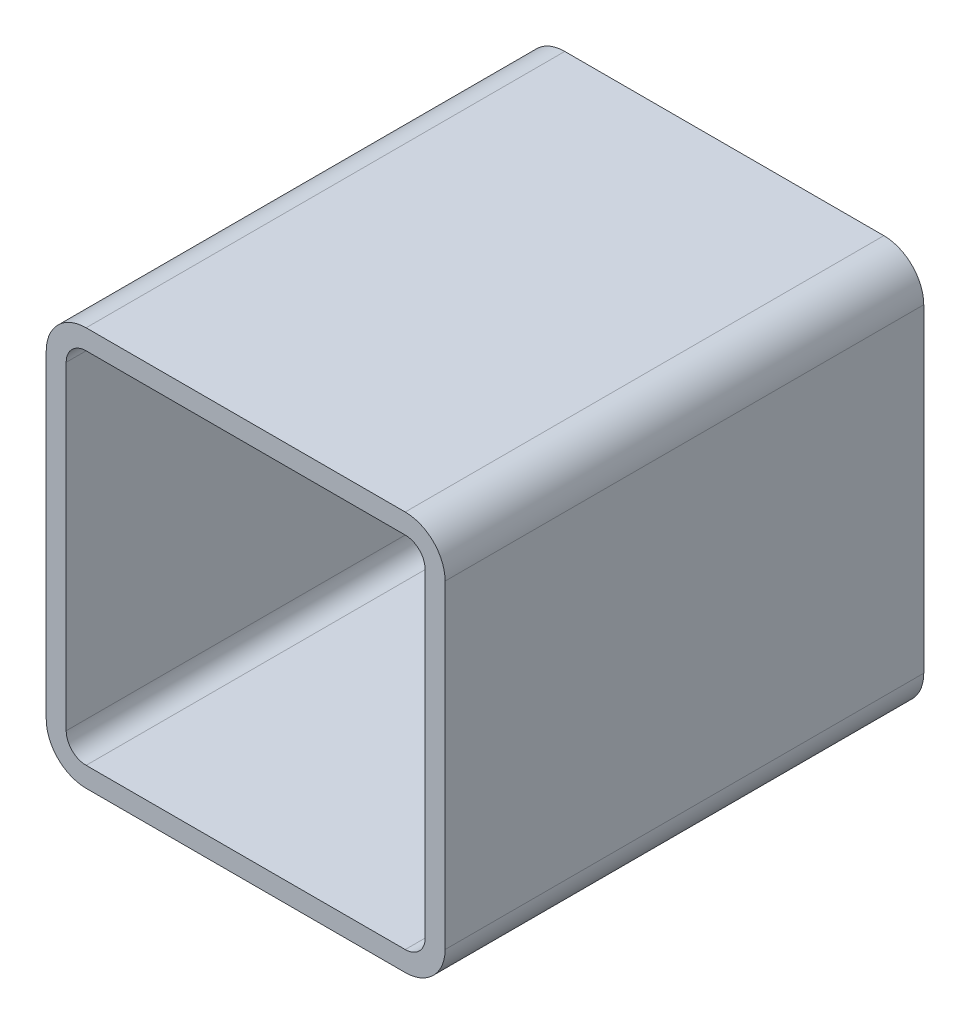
ISO-10303-21;
HEADER;
FILE_DESCRIPTION(('STEP AP214'),'2;1');
FILE_NAME('part.step','',(''),(''),'','','');
FILE_SCHEMA(('AUTOMOTIVE_DESIGN { 1 0 10303 214 1 1 1 1 }'));
ENDSEC;
DATA;
#1=APPLICATION_CONTEXT('core data for automotive mechanical design processes');
#2=APPLICATION_PROTOCOL_DEFINITION('international standard','automotive_design',2000,#1);
#3=PRODUCT_CONTEXT('',#1,'mechanical');
#4=PRODUCT('Part','Part','',(#3));
#5=PRODUCT_RELATED_PRODUCT_CATEGORY('part','',(#4));
#6=PRODUCT_DEFINITION_FORMATION('','',#4);
#7=PRODUCT_DEFINITION_CONTEXT('part definition',#1,'design');
#8=PRODUCT_DEFINITION('design','',#6,#7);
#9=PRODUCT_DEFINITION_SHAPE('','',#8);
#10=(LENGTH_UNIT() NAMED_UNIT(*) SI_UNIT(.MILLI.,.METRE.));
#11=(NAMED_UNIT(*) PLANE_ANGLE_UNIT() SI_UNIT($,.RADIAN.));
#12=(NAMED_UNIT(*) SI_UNIT($,.STERADIAN.) SOLID_ANGLE_UNIT());
#13=UNCERTAINTY_MEASURE_WITH_UNIT(LENGTH_MEASURE(1.E-05),#10,'distance_accuracy_value','');
#14=(GEOMETRIC_REPRESENTATION_CONTEXT(3) GLOBAL_UNCERTAINTY_ASSIGNED_CONTEXT((#13)) GLOBAL_UNIT_ASSIGNED_CONTEXT((#10,
#11,#12)) REPRESENTATION_CONTEXT('',''));
#15=CARTESIAN_POINT('',(0.,0.,0.));
#16=DIRECTION('',(0.,0.,1.));
#17=DIRECTION('',(1.,0.,0.));
#18=AXIS2_PLACEMENT_3D('',#15,#16,#17);
#19=CARTESIAN_POINT('',(28.1345794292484,230.520313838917,304.8));
#20=DIRECTION('',(0.,0.,1.));
#21=DIRECTION('',(1.,0.,0.));
#22=AXIS2_PLACEMENT_3D('',#19,#20,#21);
#23=PLANE('',#22);
#24=CARTESIAN_POINT('',(28.1345794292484,230.520313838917,304.8));
#25=DIRECTION('',(0.,0.,1.));
#26=DIRECTION('',(1.,0.,0.));
#27=AXIS2_PLACEMENT_3D('',#24,#25,#26);
#28=CIRCLE('',#27,25.4);
#29=CARTESIAN_POINT('',(28.1345794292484,255.920313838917,304.8));
#30=VERTEX_POINT('',#29);
#31=CARTESIAN_POINT('',(2.73457942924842,230.520313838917,304.8));
#32=VERTEX_POINT('',#31);
#33=EDGE_CURVE('E211',#30,#32,#28,.T.);
#34=ORIENTED_EDGE('',*,*,#33,.T.);
#35=DIRECTION('',(0.,-1.,0.));
#36=VECTOR('',#35,1.);
#37=CARTESIAN_POINT('',(2.73457942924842,27.3203138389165,304.8));
#38=LINE('',#37,#36);
#39=CARTESIAN_POINT('',(2.73457942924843,27.3203138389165,304.8));
#40=VERTEX_POINT('',#39);
#41=EDGE_CURVE('E214',#32,#40,#38,.T.);
#42=ORIENTED_EDGE('',*,*,#41,.T.);
#43=CARTESIAN_POINT('',(28.1345794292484,27.3203138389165,304.8));
#44=DIRECTION('',(0.,0.,1.));
#45=DIRECTION('',(1.,0.,0.));
#46=AXIS2_PLACEMENT_3D('',#43,#44,#45);
#47=CIRCLE('',#46,25.4);
#48=CARTESIAN_POINT('',(28.1345794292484,1.92031383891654,304.8));
#49=VERTEX_POINT('',#48);
#50=EDGE_CURVE('E217',#40,#49,#47,.T.);
#51=ORIENTED_EDGE('',*,*,#50,.T.);
#52=DIRECTION('',(1.,0.,0.));
#53=VECTOR('',#52,1.);
#54=CARTESIAN_POINT('',(231.334579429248,1.92031383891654,304.8));
#55=LINE('',#54,#53);
#56=CARTESIAN_POINT('',(231.334579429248,1.92031383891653,304.8));
#57=VERTEX_POINT('',#56);
#58=EDGE_CURVE('E219',#49,#57,#55,.T.);
#59=ORIENTED_EDGE('',*,*,#58,.T.);
#60=CARTESIAN_POINT('',(231.334579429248,27.3203138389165,304.8));
#61=DIRECTION('',(0.,0.,1.));
#62=DIRECTION('',(1.,0.,0.));
#63=AXIS2_PLACEMENT_3D('',#60,#61,#62);
#64=CIRCLE('',#63,25.4);
#65=CARTESIAN_POINT('',(256.734579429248,27.3203138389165,304.8));
#66=VERTEX_POINT('',#65);
#67=EDGE_CURVE('E221',#57,#66,#64,.T.);
#68=ORIENTED_EDGE('',*,*,#67,.T.);
#69=DIRECTION('',(0.,1.,0.));
#70=VECTOR('',#69,1.);
#71=CARTESIAN_POINT('',(256.734579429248,230.520313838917,304.8));
#72=LINE('',#71,#70);
#73=CARTESIAN_POINT('',(256.734579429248,230.520313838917,304.8));
#74=VERTEX_POINT('',#73);
#75=EDGE_CURVE('E223',#66,#74,#72,.T.);
#76=ORIENTED_EDGE('',*,*,#75,.T.);
#77=CARTESIAN_POINT('',(231.334579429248,230.520313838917,304.8));
#78=DIRECTION('',(0.,0.,1.));
#79=DIRECTION('',(1.,0.,0.));
#80=AXIS2_PLACEMENT_3D('',#77,#78,#79);
#81=CIRCLE('',#80,25.4);
#82=CARTESIAN_POINT('',(231.334579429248,255.920313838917,304.8));
#83=VERTEX_POINT('',#82);
#84=EDGE_CURVE('E225',#74,#83,#81,.T.);
#85=ORIENTED_EDGE('',*,*,#84,.T.);
#86=DIRECTION('',(-1.,0.,0.));
#87=VECTOR('',#86,1.);
#88=CARTESIAN_POINT('',(28.1345794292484,255.920313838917,304.8));
#89=LINE('',#88,#87);
#90=EDGE_CURVE('E227',#83,#30,#89,.T.);
#91=ORIENTED_EDGE('',*,*,#90,.T.);
#92=EDGE_LOOP('',(#34,#42,#51,#59,#68,#76,#85,#91));
#93=FACE_BOUND('',#92,.T.);
#94=DIRECTION('',(0.,-1.,0.));
#95=VECTOR('',#94,1.);
#96=CARTESIAN_POINT('',(15.4345794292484,27.3203138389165,304.8));
#97=LINE('',#96,#95);
#98=CARTESIAN_POINT('',(15.4345794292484,230.520313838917,304.8));
#99=VERTEX_POINT('',#98);
#100=CARTESIAN_POINT('',(15.4345794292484,27.3203138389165,304.8));
#101=VERTEX_POINT('',#100);
#102=EDGE_CURVE('E154',#99,#101,#97,.T.);
#103=ORIENTED_EDGE('',*,*,#102,.F.);
#104=CARTESIAN_POINT('',(28.1345794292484,230.520313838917,304.8));
#105=DIRECTION('',(0.,0.,1.));
#106=DIRECTION('',(1.,0.,0.));
#107=AXIS2_PLACEMENT_3D('',#104,#105,#106);
#108=CIRCLE('',#107,12.7);
#109=CARTESIAN_POINT('',(28.1345794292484,243.220313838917,304.8));
#110=VERTEX_POINT('',#109);
#111=EDGE_CURVE('E146',#110,#99,#108,.T.);
#112=ORIENTED_EDGE('',*,*,#111,.F.);
#113=DIRECTION('',(-1.,0.,0.));
#114=VECTOR('',#113,1.);
#115=CARTESIAN_POINT('',(28.1345794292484,243.220313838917,304.8));
#116=LINE('',#115,#114);
#117=CARTESIAN_POINT('',(231.334579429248,243.220313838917,304.8));
#118=VERTEX_POINT('',#117);
#119=EDGE_CURVE('E179',#118,#110,#116,.T.);
#120=ORIENTED_EDGE('',*,*,#119,.F.);
#121=CARTESIAN_POINT('',(231.334579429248,230.520313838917,304.8));
#122=DIRECTION('',(0.,0.,1.));
#123=DIRECTION('',(1.,0.,0.));
#124=AXIS2_PLACEMENT_3D('',#121,#122,#123);
#125=CIRCLE('',#124,12.7);
#126=CARTESIAN_POINT('',(244.034579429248,230.520313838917,304.8));
#127=VERTEX_POINT('',#126);
#128=EDGE_CURVE('E177',#127,#118,#125,.T.);
#129=ORIENTED_EDGE('',*,*,#128,.F.);
#130=DIRECTION('',(0.,1.,0.));
#131=VECTOR('',#130,1.);
#132=CARTESIAN_POINT('',(244.034579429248,230.520313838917,304.8));
#133=LINE('',#132,#131);
#134=CARTESIAN_POINT('',(244.034579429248,27.3203138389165,304.8));
#135=VERTEX_POINT('',#134);
#136=EDGE_CURVE('E175',#135,#127,#133,.T.);
#137=ORIENTED_EDGE('',*,*,#136,.F.);
#138=CARTESIAN_POINT('',(231.334579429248,27.3203138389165,304.8));
#139=DIRECTION('',(0.,0.,1.));
#140=DIRECTION('',(1.,0.,0.));
#141=AXIS2_PLACEMENT_3D('',#138,#139,#140);
#142=CIRCLE('',#141,12.7);
#143=CARTESIAN_POINT('',(231.334579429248,14.6203138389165,304.8));
#144=VERTEX_POINT('',#143);
#145=EDGE_CURVE('E173',#144,#135,#142,.T.);
#146=ORIENTED_EDGE('',*,*,#145,.F.);
#147=DIRECTION('',(1.,0.,0.));
#148=VECTOR('',#147,1.);
#149=CARTESIAN_POINT('',(231.334579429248,14.6203138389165,304.8));
#150=LINE('',#149,#148);
#151=CARTESIAN_POINT('',(28.1345794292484,14.6203138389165,304.8));
#152=VERTEX_POINT('',#151);
#153=EDGE_CURVE('E169',#152,#144,#150,.T.);
#154=ORIENTED_EDGE('',*,*,#153,.F.);
#155=CARTESIAN_POINT('',(28.1345794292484,27.3203138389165,304.8));
#156=DIRECTION('',(0.,0.,1.));
#157=DIRECTION('',(1.,0.,0.));
#158=AXIS2_PLACEMENT_3D('',#155,#156,#157);
#159=CIRCLE('',#158,12.7);
#160=EDGE_CURVE('E167',#101,#152,#159,.T.);
#161=ORIENTED_EDGE('',*,*,#160,.F.);
#162=EDGE_LOOP('',(#103,#112,#120,#129,#137,#146,#154,#161));
#163=FACE_BOUND('',#162,.T.);
#164=ADVANCED_FACE('F33',(#93,#163),#23,.T.);
#165=CARTESIAN_POINT('',(28.1345794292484,230.520313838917,0.));
#166=DIRECTION('',(0.,0.,1.));
#167=DIRECTION('',(1.,0.,0.));
#168=AXIS2_PLACEMENT_3D('',#165,#166,#167);
#169=PLANE('',#168);
#170=CARTESIAN_POINT('',(28.1345794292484,230.520313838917,0.));
#171=DIRECTION('',(0.,0.,1.));
#172=DIRECTION('',(1.,0.,0.));
#173=AXIS2_PLACEMENT_3D('',#170,#171,#172);
#174=CIRCLE('',#173,25.4);
#175=CARTESIAN_POINT('',(28.1345794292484,255.920313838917,0.));
#176=VERTEX_POINT('',#175);
#177=CARTESIAN_POINT('',(2.73457942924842,230.520313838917,0.));
#178=VERTEX_POINT('',#177);
#179=EDGE_CURVE('E162',#176,#178,#174,.T.);
#180=ORIENTED_EDGE('',*,*,#179,.F.);
#181=DIRECTION('',(-1.,0.,0.));
#182=VECTOR('',#181,1.);
#183=CARTESIAN_POINT('',(28.1345794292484,255.920313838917,0.));
#184=LINE('',#183,#182);
#185=CARTESIAN_POINT('',(231.334579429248,255.920313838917,0.));
#186=VERTEX_POINT('',#185);
#187=EDGE_CURVE('E215',#186,#176,#184,.T.);
#188=ORIENTED_EDGE('',*,*,#187,.F.);
#189=CARTESIAN_POINT('',(231.334579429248,230.520313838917,0.));
#190=DIRECTION('',(0.,0.,1.));
#191=DIRECTION('',(1.,0.,0.));
#192=AXIS2_PLACEMENT_3D('',#189,#190,#191);
#193=CIRCLE('',#192,25.4);
#194=CARTESIAN_POINT('',(256.734579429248,230.520313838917,0.));
#195=VERTEX_POINT('',#194);
#196=EDGE_CURVE('E242',#195,#186,#193,.T.);
#197=ORIENTED_EDGE('',*,*,#196,.F.);
#198=DIRECTION('',(0.,1.,0.));
#199=VECTOR('',#198,1.);
#200=CARTESIAN_POINT('',(256.734579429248,230.520313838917,0.));
#201=LINE('',#200,#199);
#202=CARTESIAN_POINT('',(256.734579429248,27.3203138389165,0.));
#203=VERTEX_POINT('',#202);
#204=EDGE_CURVE('E240',#203,#195,#201,.T.);
#205=ORIENTED_EDGE('',*,*,#204,.F.);
#206=CARTESIAN_POINT('',(231.334579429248,27.3203138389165,0.));
#207=DIRECTION('',(0.,0.,1.));
#208=DIRECTION('',(1.,0.,0.));
#209=AXIS2_PLACEMENT_3D('',#206,#207,#208);
#210=CIRCLE('',#209,25.4);
#211=CARTESIAN_POINT('',(231.334579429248,1.92031383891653,0.));
#212=VERTEX_POINT('',#211);
#213=EDGE_CURVE('E238',#212,#203,#210,.T.);
#214=ORIENTED_EDGE('',*,*,#213,.F.);
#215=DIRECTION('',(1.,0.,0.));
#216=VECTOR('',#215,1.);
#217=CARTESIAN_POINT('',(231.334579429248,1.92031383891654,0.));
#218=LINE('',#217,#216);
#219=CARTESIAN_POINT('',(28.1345794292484,1.92031383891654,0.));
#220=VERTEX_POINT('',#219);
#221=EDGE_CURVE('E236',#220,#212,#218,.T.);
#222=ORIENTED_EDGE('',*,*,#221,.F.);
#223=CARTESIAN_POINT('',(28.1345794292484,27.3203138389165,0.));
#224=DIRECTION('',(0.,0.,1.));
#225=DIRECTION('',(1.,0.,0.));
#226=AXIS2_PLACEMENT_3D('',#223,#224,#225);
#227=CIRCLE('',#226,25.4);
#228=CARTESIAN_POINT('',(2.73457942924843,27.3203138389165,0.));
#229=VERTEX_POINT('',#228);
#230=EDGE_CURVE('E234',#229,#220,#227,.T.);
#231=ORIENTED_EDGE('',*,*,#230,.F.);
#232=DIRECTION('',(0.,-1.,0.));
#233=VECTOR('',#232,1.);
#234=CARTESIAN_POINT('',(2.73457942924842,27.3203138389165,0.));
#235=LINE('',#234,#233);
#236=EDGE_CURVE('E232',#178,#229,#235,.T.);
#237=ORIENTED_EDGE('',*,*,#236,.F.);
#238=EDGE_LOOP('',(#180,#188,#197,#205,#214,#222,#231,#237));
#239=FACE_BOUND('',#238,.T.);
#240=CARTESIAN_POINT('',(28.1345794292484,230.520313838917,0.));
#241=DIRECTION('',(0.,0.,1.));
#242=DIRECTION('',(1.,0.,0.));
#243=AXIS2_PLACEMENT_3D('',#240,#241,#242);
#244=CIRCLE('',#243,12.7);
#245=CARTESIAN_POINT('',(28.1345794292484,243.220313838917,0.));
#246=VERTEX_POINT('',#245);
#247=CARTESIAN_POINT('',(15.4345794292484,230.520313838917,0.));
#248=VERTEX_POINT('',#247);
#249=EDGE_CURVE('E56',#246,#248,#244,.T.);
#250=ORIENTED_EDGE('',*,*,#249,.T.);
#251=DIRECTION('',(0.,-1.,0.));
#252=VECTOR('',#251,1.);
#253=CARTESIAN_POINT('',(15.4345794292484,27.3203138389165,0.));
#254=LINE('',#253,#252);
#255=CARTESIAN_POINT('',(15.4345794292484,27.3203138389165,0.));
#256=VERTEX_POINT('',#255);
#257=EDGE_CURVE('E161',#248,#256,#254,.T.);
#258=ORIENTED_EDGE('',*,*,#257,.T.);
#259=CARTESIAN_POINT('',(28.1345794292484,27.3203138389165,0.));
#260=DIRECTION('',(0.,0.,1.));
#261=DIRECTION('',(1.,0.,0.));
#262=AXIS2_PLACEMENT_3D('',#259,#260,#261);
#263=CIRCLE('',#262,12.7);
#264=CARTESIAN_POINT('',(28.1345794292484,14.6203138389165,0.));
#265=VERTEX_POINT('',#264);
#266=EDGE_CURVE('E183',#256,#265,#263,.T.);
#267=ORIENTED_EDGE('',*,*,#266,.T.);
#268=DIRECTION('',(1.,0.,0.));
#269=VECTOR('',#268,1.);
#270=CARTESIAN_POINT('',(231.334579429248,14.6203138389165,0.));
#271=LINE('',#270,#269);
#272=CARTESIAN_POINT('',(231.334579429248,14.6203138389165,0.));
#273=VERTEX_POINT('',#272);
#274=EDGE_CURVE('E186',#265,#273,#271,.T.);
#275=ORIENTED_EDGE('',*,*,#274,.T.);
#276=CARTESIAN_POINT('',(231.334579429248,27.3203138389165,0.));
#277=DIRECTION('',(0.,0.,1.));
#278=DIRECTION('',(1.,0.,0.));
#279=AXIS2_PLACEMENT_3D('',#276,#277,#278);
#280=CIRCLE('',#279,12.7);
#281=CARTESIAN_POINT('',(244.034579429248,27.3203138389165,0.));
#282=VERTEX_POINT('',#281);
#283=EDGE_CURVE('E189',#273,#282,#280,.T.);
#284=ORIENTED_EDGE('',*,*,#283,.T.);
#285=DIRECTION('',(0.,1.,0.));
#286=VECTOR('',#285,1.);
#287=CARTESIAN_POINT('',(244.034579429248,230.520313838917,0.));
#288=LINE('',#287,#286);
#289=CARTESIAN_POINT('',(244.034579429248,230.520313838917,0.));
#290=VERTEX_POINT('',#289);
#291=EDGE_CURVE('E192',#282,#290,#288,.T.);
#292=ORIENTED_EDGE('',*,*,#291,.T.);
#293=CARTESIAN_POINT('',(231.334579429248,230.520313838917,0.));
#294=DIRECTION('',(0.,0.,1.));
#295=DIRECTION('',(1.,0.,0.));
#296=AXIS2_PLACEMENT_3D('',#293,#294,#295);
#297=CIRCLE('',#296,12.7);
#298=CARTESIAN_POINT('',(231.334579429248,243.220313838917,0.));
#299=VERTEX_POINT('',#298);
#300=EDGE_CURVE('E195',#290,#299,#297,.T.);
#301=ORIENTED_EDGE('',*,*,#300,.T.);
#302=DIRECTION('',(-1.,0.,0.));
#303=VECTOR('',#302,1.);
#304=CARTESIAN_POINT('',(28.1345794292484,243.220313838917,0.));
#305=LINE('',#304,#303);
#306=EDGE_CURVE('E155',#299,#246,#305,.T.);
#307=ORIENTED_EDGE('',*,*,#306,.T.);
#308=EDGE_LOOP('',(#250,#258,#267,#275,#284,#292,#301,#307));
#309=FACE_BOUND('',#308,.T.);
#310=ADVANCED_FACE('F272',(#239,#309),#169,.F.);
#311=CARTESIAN_POINT('',(28.1345794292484,230.520313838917,304.8));
#312=DIRECTION('',(0.,0.,-1.));
#313=DIRECTION('',(-1.,0.,0.));
#314=AXIS2_PLACEMENT_3D('',#311,#312,#313);
#315=CYLINDRICAL_SURFACE('',#314,25.4);
#316=ORIENTED_EDGE('',*,*,#179,.T.);
#317=DIRECTION('',(0.,0.,-1.));
#318=VECTOR('',#317,1.);
#319=CARTESIAN_POINT('',(2.73457942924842,230.520313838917,304.8));
#320=LINE('',#319,#318);
#321=EDGE_CURVE('E11',#32,#178,#320,.T.);
#322=ORIENTED_EDGE('',*,*,#321,.F.);
#323=ORIENTED_EDGE('',*,*,#33,.F.);
#324=DIRECTION('',(0.,0.,-1.));
#325=VECTOR('',#324,1.);
#326=CARTESIAN_POINT('',(28.1345794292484,255.920313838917,304.8));
#327=LINE('',#326,#325);
#328=EDGE_CURVE('E229',#30,#176,#327,.T.);
#329=ORIENTED_EDGE('',*,*,#328,.T.);
#330=EDGE_LOOP('',(#316,#322,#323,#329));
#331=FACE_BOUND('',#330,.T.);
#332=ADVANCED_FACE('F35',(#331),#315,.T.);
#333=CARTESIAN_POINT('',(2.73457942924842,27.3203138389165,304.8));
#334=DIRECTION('',(1.,0.,0.));
#335=DIRECTION('',(0.,0.,-1.));
#336=AXIS2_PLACEMENT_3D('',#333,#334,#335);
#337=PLANE('',#336);
#338=ORIENTED_EDGE('',*,*,#236,.T.);
#339=DIRECTION('',(0.,0.,-1.));
#340=VECTOR('',#339,1.);
#341=CARTESIAN_POINT('',(2.73457942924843,27.3203138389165,304.8));
#342=LINE('',#341,#340);
#343=EDGE_CURVE('E41',#40,#229,#342,.T.);
#344=ORIENTED_EDGE('',*,*,#343,.F.);
#345=ORIENTED_EDGE('',*,*,#41,.F.);
#346=ORIENTED_EDGE('',*,*,#321,.T.);
#347=EDGE_LOOP('',(#338,#344,#345,#346));
#348=FACE_BOUND('',#347,.T.);
#349=ADVANCED_FACE('F289',(#348),#337,.F.);
#350=CARTESIAN_POINT('',(28.1345794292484,27.3203138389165,304.8));
#351=DIRECTION('',(0.,0.,-1.));
#352=DIRECTION('',(-1.,0.,0.));
#353=AXIS2_PLACEMENT_3D('',#350,#351,#352);
#354=CYLINDRICAL_SURFACE('',#353,25.4);
#355=ORIENTED_EDGE('',*,*,#230,.T.);
#356=DIRECTION('',(0.,0.,-1.));
#357=VECTOR('',#356,1.);
#358=CARTESIAN_POINT('',(28.1345794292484,1.92031383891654,304.8));
#359=LINE('',#358,#357);
#360=EDGE_CURVE('E259',#49,#220,#359,.T.);
#361=ORIENTED_EDGE('',*,*,#360,.F.);
#362=ORIENTED_EDGE('',*,*,#50,.F.);
#363=ORIENTED_EDGE('',*,*,#343,.T.);
#364=EDGE_LOOP('',(#355,#361,#362,#363));
#365=FACE_BOUND('',#364,.T.);
#366=ADVANCED_FACE('F266',(#365),#354,.T.);
#367=CARTESIAN_POINT('',(231.334579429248,1.92031383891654,304.8));
#368=DIRECTION('',(0.,1.,0.));
#369=DIRECTION('',(0.,0.,1.));
#370=AXIS2_PLACEMENT_3D('',#367,#368,#369);
#371=PLANE('',#370);
#372=ORIENTED_EDGE('',*,*,#221,.T.);
#373=DIRECTION('',(0.,0.,-1.));
#374=VECTOR('',#373,1.);
#375=CARTESIAN_POINT('',(231.334579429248,1.92031383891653,304.8));
#376=LINE('',#375,#374);
#377=EDGE_CURVE('E256',#57,#212,#376,.T.);
#378=ORIENTED_EDGE('',*,*,#377,.F.);
#379=ORIENTED_EDGE('',*,*,#58,.F.);
#380=ORIENTED_EDGE('',*,*,#360,.T.);
#381=EDGE_LOOP('',(#372,#378,#379,#380));
#382=FACE_BOUND('',#381,.T.);
#383=ADVANCED_FACE('F278',(#382),#371,.F.);
#384=CARTESIAN_POINT('',(231.334579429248,27.3203138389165,304.8));
#385=DIRECTION('',(0.,0.,-1.));
#386=DIRECTION('',(-1.,0.,0.));
#387=AXIS2_PLACEMENT_3D('',#384,#385,#386);
#388=CYLINDRICAL_SURFACE('',#387,25.4);
#389=ORIENTED_EDGE('',*,*,#213,.T.);
#390=DIRECTION('',(0.,0.,-1.));
#391=VECTOR('',#390,1.);
#392=CARTESIAN_POINT('',(256.734579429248,27.3203138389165,304.8));
#393=LINE('',#392,#391);
#394=EDGE_CURVE('E253',#66,#203,#393,.T.);
#395=ORIENTED_EDGE('',*,*,#394,.F.);
#396=ORIENTED_EDGE('',*,*,#67,.F.);
#397=ORIENTED_EDGE('',*,*,#377,.T.);
#398=EDGE_LOOP('',(#389,#395,#396,#397));
#399=FACE_BOUND('',#398,.T.);
#400=ADVANCED_FACE('F282',(#399),#388,.T.);
#401=CARTESIAN_POINT('',(256.734579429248,230.520313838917,304.8));
#402=DIRECTION('',(-1.,0.,0.));
#403=DIRECTION('',(0.,0.,1.));
#404=AXIS2_PLACEMENT_3D('',#401,#402,#403);
#405=PLANE('',#404);
#406=ORIENTED_EDGE('',*,*,#204,.T.);
#407=DIRECTION('',(0.,0.,-1.));
#408=VECTOR('',#407,1.);
#409=CARTESIAN_POINT('',(256.734579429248,230.520313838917,304.8));
#410=LINE('',#409,#408);
#411=EDGE_CURVE('E250',#74,#195,#410,.T.);
#412=ORIENTED_EDGE('',*,*,#411,.F.);
#413=ORIENTED_EDGE('',*,*,#75,.F.);
#414=ORIENTED_EDGE('',*,*,#394,.T.);
#415=EDGE_LOOP('',(#406,#412,#413,#414));
#416=FACE_BOUND('',#415,.T.);
#417=ADVANCED_FACE('F302',(#416),#405,.F.);
#418=CARTESIAN_POINT('',(231.334579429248,230.520313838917,304.8));
#419=DIRECTION('',(0.,0.,-1.));
#420=DIRECTION('',(-1.,0.,0.));
#421=AXIS2_PLACEMENT_3D('',#418,#419,#420);
#422=CYLINDRICAL_SURFACE('',#421,25.4);
#423=ORIENTED_EDGE('',*,*,#196,.T.);
#424=DIRECTION('',(0.,0.,-1.));
#425=VECTOR('',#424,1.);
#426=CARTESIAN_POINT('',(231.334579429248,255.920313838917,304.8));
#427=LINE('',#426,#425);
#428=EDGE_CURVE('E247',#83,#186,#427,.T.);
#429=ORIENTED_EDGE('',*,*,#428,.F.);
#430=ORIENTED_EDGE('',*,*,#84,.F.);
#431=ORIENTED_EDGE('',*,*,#411,.T.);
#432=EDGE_LOOP('',(#423,#429,#430,#431));
#433=FACE_BOUND('',#432,.T.);
#434=ADVANCED_FACE('F300',(#433),#422,.T.);
#435=CARTESIAN_POINT('',(28.1345794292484,255.920313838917,304.8));
#436=DIRECTION('',(0.,-1.,0.));
#437=DIRECTION('',(0.,0.,-1.));
#438=AXIS2_PLACEMENT_3D('',#435,#436,#437);
#439=PLANE('',#438);
#440=ORIENTED_EDGE('',*,*,#187,.T.);
#441=ORIENTED_EDGE('',*,*,#328,.F.);
#442=ORIENTED_EDGE('',*,*,#90,.F.);
#443=ORIENTED_EDGE('',*,*,#428,.T.);
#444=EDGE_LOOP('',(#440,#441,#442,#443));
#445=FACE_BOUND('',#444,.T.);
#446=ADVANCED_FACE('F295',(#445),#439,.F.);
#447=CARTESIAN_POINT('',(28.1345794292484,230.520313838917,304.8));
#448=DIRECTION('',(0.,0.,-1.));
#449=DIRECTION('',(-1.,0.,0.));
#450=AXIS2_PLACEMENT_3D('',#447,#448,#449);
#451=CYLINDRICAL_SURFACE('',#450,12.7);
#452=ORIENTED_EDGE('',*,*,#249,.F.);
#453=DIRECTION('',(0.,0.,-1.));
#454=VECTOR('',#453,1.);
#455=CARTESIAN_POINT('',(28.1345794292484,243.220313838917,304.8));
#456=LINE('',#455,#454);
#457=EDGE_CURVE('E150',#110,#246,#456,.T.);
#458=ORIENTED_EDGE('',*,*,#457,.F.);
#459=ORIENTED_EDGE('',*,*,#111,.T.);
#460=DIRECTION('',(0.,0.,-1.));
#461=VECTOR('',#460,1.);
#462=CARTESIAN_POINT('',(15.4345794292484,230.520313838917,304.8));
#463=LINE('',#462,#461);
#464=EDGE_CURVE('E149',#99,#248,#463,.T.);
#465=ORIENTED_EDGE('',*,*,#464,.T.);
#466=EDGE_LOOP('',(#452,#458,#459,#465));
#467=FACE_BOUND('',#466,.T.);
#468=ADVANCED_FACE('F148',(#467),#451,.F.);
#469=CARTESIAN_POINT('',(15.4345794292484,27.3203138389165,304.8));
#470=DIRECTION('',(1.,0.,0.));
#471=DIRECTION('',(0.,0.,-1.));
#472=AXIS2_PLACEMENT_3D('',#469,#470,#471);
#473=PLANE('',#472);
#474=ORIENTED_EDGE('',*,*,#257,.F.);
#475=ORIENTED_EDGE('',*,*,#464,.F.);
#476=ORIENTED_EDGE('',*,*,#102,.T.);
#477=DIRECTION('',(0.,0.,-1.));
#478=VECTOR('',#477,1.);
#479=CARTESIAN_POINT('',(15.4345794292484,27.3203138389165,304.8));
#480=LINE('',#479,#478);
#481=EDGE_CURVE('E163',#101,#256,#480,.T.);
#482=ORIENTED_EDGE('',*,*,#481,.T.);
#483=EDGE_LOOP('',(#474,#475,#476,#482));
#484=FACE_BOUND('',#483,.T.);
#485=ADVANCED_FACE('F158',(#484),#473,.T.);
#486=CARTESIAN_POINT('',(28.1345794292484,27.3203138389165,304.8));
#487=DIRECTION('',(0.,0.,-1.));
#488=DIRECTION('',(-1.,0.,0.));
#489=AXIS2_PLACEMENT_3D('',#486,#487,#488);
#490=CYLINDRICAL_SURFACE('',#489,12.7);
#491=ORIENTED_EDGE('',*,*,#266,.F.);
#492=ORIENTED_EDGE('',*,*,#481,.F.);
#493=ORIENTED_EDGE('',*,*,#160,.T.);
#494=DIRECTION('',(0.,0.,-1.));
#495=VECTOR('',#494,1.);
#496=CARTESIAN_POINT('',(28.1345794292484,14.6203138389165,304.8));
#497=LINE('',#496,#495);
#498=EDGE_CURVE('E208',#152,#265,#497,.T.);
#499=ORIENTED_EDGE('',*,*,#498,.T.);
#500=EDGE_LOOP('',(#491,#492,#493,#499));
#501=FACE_BOUND('',#500,.T.);
#502=ADVANCED_FACE('F327',(#501),#490,.F.);
#503=CARTESIAN_POINT('',(231.334579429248,14.6203138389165,304.8));
#504=DIRECTION('',(0.,1.,0.));
#505=DIRECTION('',(0.,0.,1.));
#506=AXIS2_PLACEMENT_3D('',#503,#504,#505);
#507=PLANE('',#506);
#508=ORIENTED_EDGE('',*,*,#274,.F.);
#509=ORIENTED_EDGE('',*,*,#498,.F.);
#510=ORIENTED_EDGE('',*,*,#153,.T.);
#511=DIRECTION('',(0.,0.,-1.));
#512=VECTOR('',#511,1.);
#513=CARTESIAN_POINT('',(231.334579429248,14.6203138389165,304.8));
#514=LINE('',#513,#512);
#515=EDGE_CURVE('E206',#144,#273,#514,.T.);
#516=ORIENTED_EDGE('',*,*,#515,.T.);
#517=EDGE_LOOP('',(#508,#509,#510,#516));
#518=FACE_BOUND('',#517,.T.);
#519=ADVANCED_FACE('F331',(#518),#507,.T.);
#520=CARTESIAN_POINT('',(231.334579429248,27.3203138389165,304.8));
#521=DIRECTION('',(0.,0.,-1.));
#522=DIRECTION('',(-1.,0.,0.));
#523=AXIS2_PLACEMENT_3D('',#520,#521,#522);
#524=CYLINDRICAL_SURFACE('',#523,12.7);
#525=ORIENTED_EDGE('',*,*,#283,.F.);
#526=ORIENTED_EDGE('',*,*,#515,.F.);
#527=ORIENTED_EDGE('',*,*,#145,.T.);
#528=DIRECTION('',(0.,0.,-1.));
#529=VECTOR('',#528,1.);
#530=CARTESIAN_POINT('',(244.034579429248,27.3203138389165,304.8));
#531=LINE('',#530,#529);
#532=EDGE_CURVE('E204',#135,#282,#531,.T.);
#533=ORIENTED_EDGE('',*,*,#532,.T.);
#534=EDGE_LOOP('',(#525,#526,#527,#533));
#535=FACE_BOUND('',#534,.T.);
#536=ADVANCED_FACE('F337',(#535),#524,.F.);
#537=CARTESIAN_POINT('',(244.034579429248,230.520313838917,304.8));
#538=DIRECTION('',(-1.,0.,0.));
#539=DIRECTION('',(0.,0.,1.));
#540=AXIS2_PLACEMENT_3D('',#537,#538,#539);
#541=PLANE('',#540);
#542=ORIENTED_EDGE('',*,*,#291,.F.);
#543=ORIENTED_EDGE('',*,*,#532,.F.);
#544=ORIENTED_EDGE('',*,*,#136,.T.);
#545=DIRECTION('',(0.,0.,-1.));
#546=VECTOR('',#545,1.);
#547=CARTESIAN_POINT('',(244.034579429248,230.520313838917,304.8));
#548=LINE('',#547,#546);
#549=EDGE_CURVE('E202',#127,#290,#548,.T.);
#550=ORIENTED_EDGE('',*,*,#549,.T.);
#551=EDGE_LOOP('',(#542,#543,#544,#550));
#552=FACE_BOUND('',#551,.T.);
#553=ADVANCED_FACE('F341',(#552),#541,.T.);
#554=CARTESIAN_POINT('',(231.334579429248,230.520313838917,304.8));
#555=DIRECTION('',(0.,0.,-1.));
#556=DIRECTION('',(-1.,0.,0.));
#557=AXIS2_PLACEMENT_3D('',#554,#555,#556);
#558=CYLINDRICAL_SURFACE('',#557,12.7);
#559=ORIENTED_EDGE('',*,*,#300,.F.);
#560=ORIENTED_EDGE('',*,*,#549,.F.);
#561=ORIENTED_EDGE('',*,*,#128,.T.);
#562=DIRECTION('',(0.,0.,-1.));
#563=VECTOR('',#562,1.);
#564=CARTESIAN_POINT('',(231.334579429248,243.220313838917,304.8));
#565=LINE('',#564,#563);
#566=EDGE_CURVE('E48',#118,#299,#565,.T.);
#567=ORIENTED_EDGE('',*,*,#566,.T.);
#568=EDGE_LOOP('',(#559,#560,#561,#567));
#569=FACE_BOUND('',#568,.T.);
#570=ADVANCED_FACE('F345',(#569),#558,.F.);
#571=CARTESIAN_POINT('',(28.1345794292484,243.220313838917,304.8));
#572=DIRECTION('',(0.,-1.,0.));
#573=DIRECTION('',(0.,0.,-1.));
#574=AXIS2_PLACEMENT_3D('',#571,#572,#573);
#575=PLANE('',#574);
#576=ORIENTED_EDGE('',*,*,#306,.F.);
#577=ORIENTED_EDGE('',*,*,#566,.F.);
#578=ORIENTED_EDGE('',*,*,#119,.T.);
#579=ORIENTED_EDGE('',*,*,#457,.T.);
#580=EDGE_LOOP('',(#576,#577,#578,#579));
#581=FACE_BOUND('',#580,.T.);
#582=ADVANCED_FACE('F349',(#581),#575,.T.);
#583=CLOSED_SHELL('',(#164,#310,#332,#349,#366,#383,#400,#417,#434,#446,#468,#485,#502,#519,
#536,#553,#570,#582));
#584=MANIFOLD_SOLID_BREP('B2',#583);
#585=ADVANCED_BREP_SHAPE_REPRESENTATION('',(#18,#584),#14);
#586=SHAPE_DEFINITION_REPRESENTATION(#9,#585);
ENDSEC;
END-ISO-10303-21;
